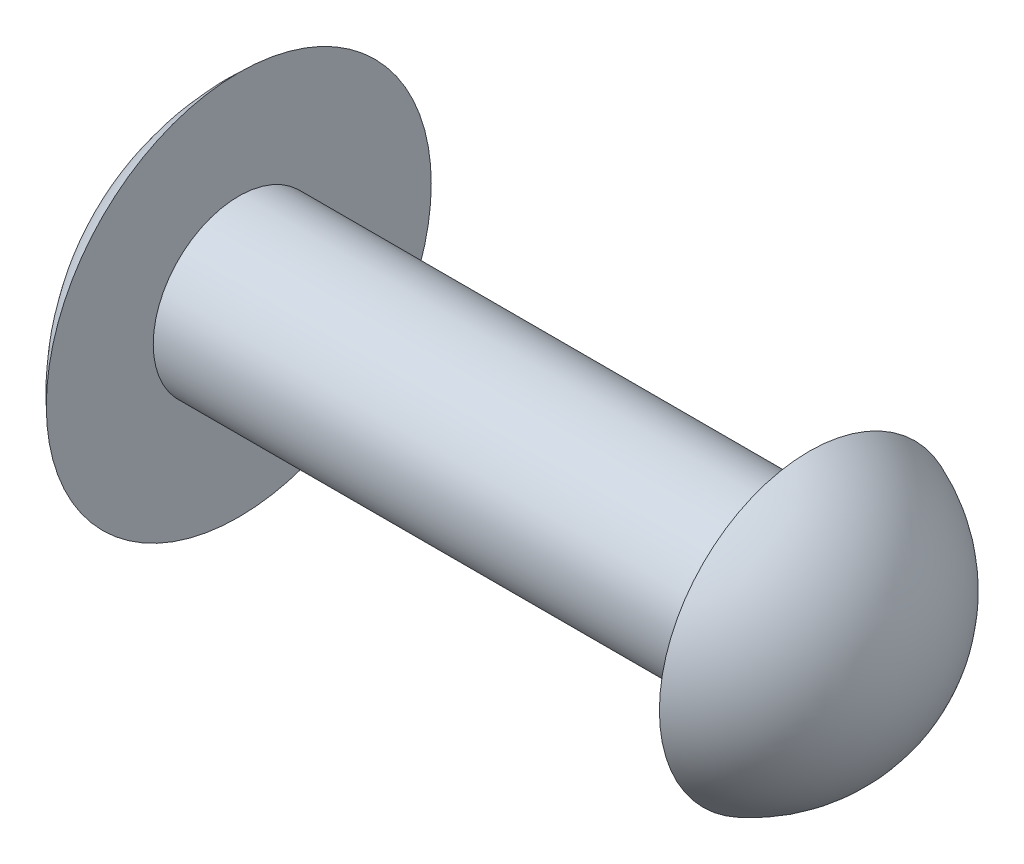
ISO-10303-21;
HEADER;
FILE_DESCRIPTION(('STEP AP214'),'2;1');
FILE_NAME('part.step','',(''),(''),'','','');
FILE_SCHEMA(('AUTOMOTIVE_DESIGN { 1 0 10303 214 1 1 1 1 }'));
ENDSEC;
DATA;
#1=APPLICATION_CONTEXT('core data for automotive mechanical design processes');
#2=APPLICATION_PROTOCOL_DEFINITION('international standard','automotive_design',2000,#1);
#3=PRODUCT_CONTEXT('',#1,'mechanical');
#4=PRODUCT('Part','Part','',(#3));
#5=PRODUCT_RELATED_PRODUCT_CATEGORY('part','',(#4));
#6=PRODUCT_DEFINITION_FORMATION('','',#4);
#7=PRODUCT_DEFINITION_CONTEXT('part definition',#1,'design');
#8=PRODUCT_DEFINITION('design','',#6,#7);
#9=PRODUCT_DEFINITION_SHAPE('','',#8);
#10=(LENGTH_UNIT() NAMED_UNIT(*) SI_UNIT(.MILLI.,.METRE.));
#11=(NAMED_UNIT(*) PLANE_ANGLE_UNIT() SI_UNIT($,.RADIAN.));
#12=(NAMED_UNIT(*) SI_UNIT($,.STERADIAN.) SOLID_ANGLE_UNIT());
#13=UNCERTAINTY_MEASURE_WITH_UNIT(LENGTH_MEASURE(1.E-05),#10,'distance_accuracy_value','');
#14=(GEOMETRIC_REPRESENTATION_CONTEXT(3) GLOBAL_UNCERTAINTY_ASSIGNED_CONTEXT((#13)) GLOBAL_UNIT_ASSIGNED_CONTEXT((#10,
#11,#12)) REPRESENTATION_CONTEXT('',''));
#15=CARTESIAN_POINT('',(0.,0.,0.));
#16=DIRECTION('',(0.,0.,1.));
#17=DIRECTION('',(1.,0.,0.));
#18=AXIS2_PLACEMENT_3D('',#15,#16,#17);
#19=CARTESIAN_POINT('',(-39.,0.,0.));
#20=DIRECTION('',(-1.,0.,0.));
#21=DIRECTION('',(0.,0.,1.));
#22=AXIS2_PLACEMENT_3D('',#19,#20,#21);
#23=CYLINDRICAL_SURFACE('',#22,3.);
#24=CARTESIAN_POINT('',(-20.,0.,0.));
#25=DIRECTION('',(-1.,0.,0.));
#26=DIRECTION('',(0.,0.,1.));
#27=AXIS2_PLACEMENT_3D('',#24,#25,#26);
#28=CIRCLE('',#27,3.);
#29=CARTESIAN_POINT('',(-20.,0.,3.));
#30=VERTEX_POINT('',#29);
#31=EDGE_CURVE('E10',#30,#30,#28,.T.);
#32=ORIENTED_EDGE('',*,*,#31,.F.);
#33=EDGE_LOOP('',(#32));
#34=FACE_BOUND('',#33,.T.);
#35=CARTESIAN_POINT('',(0.,0.,0.));
#36=DIRECTION('',(1.,0.,0.));
#37=DIRECTION('',(0.,0.,-1.));
#38=AXIS2_PLACEMENT_3D('',#35,#36,#37);
#39=CIRCLE('',#38,3.);
#40=CARTESIAN_POINT('',(0.,0.,-3.));
#41=VERTEX_POINT('',#40);
#42=EDGE_CURVE('E41',#41,#41,#39,.T.);
#43=ORIENTED_EDGE('',*,*,#42,.F.);
#44=EDGE_LOOP('',(#43));
#45=FACE_BOUND('',#44,.T.);
#46=ADVANCED_FACE('F31',(#34,#45),#23,.T.);
#47=CARTESIAN_POINT('',(-20.,3.,0.));
#48=DIRECTION('',(-1.,0.,0.));
#49=DIRECTION('',(0.,0.,1.));
#50=AXIS2_PLACEMENT_3D('',#47,#48,#49);
#51=PLANE('',#50);
#52=CARTESIAN_POINT('',(-20.,0.,0.));
#53=DIRECTION('',(-1.,0.,0.));
#54=DIRECTION('',(0.,0.,1.));
#55=AXIS2_PLACEMENT_3D('',#52,#53,#54);
#56=CIRCLE('',#55,6.75);
#57=CARTESIAN_POINT('',(-20.,0.,6.75));
#58=VERTEX_POINT('',#57);
#59=EDGE_CURVE('E37',#58,#58,#56,.T.);
#60=ORIENTED_EDGE('',*,*,#59,.F.);
#61=EDGE_LOOP('',(#60));
#62=FACE_BOUND('',#61,.T.);
#63=ORIENTED_EDGE('',*,*,#31,.T.);
#64=EDGE_LOOP('',(#63));
#65=FACE_BOUND('',#64,.T.);
#66=ADVANCED_FACE('F63',(#62,#65),#51,.F.);
#67=CARTESIAN_POINT('',(-13.90625,0.,0.));
#68=DIRECTION('',(-1.,0.,0.));
#69=DIRECTION('',(0.,1.,0.));
#70=AXIS2_PLACEMENT_3D('',#67,#68,#69);
#71=SPHERICAL_SURFACE('',#70,9.09374999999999);
#72=ORIENTED_EDGE('',*,*,#59,.T.);
#73=EDGE_LOOP('',(#72));
#74=FACE_BOUND('',#73,.T.);
#75=ADVANCED_FACE('F59',(#74),#71,.T.);
#76=CARTESIAN_POINT('',(0.,0.,0.));
#77=DIRECTION('',(1.,0.,0.));
#78=DIRECTION('',(0.,0.,-1.));
#79=AXIS2_PLACEMENT_3D('',#76,#77,#78);
#80=PLANE('',#79);
#81=ORIENTED_EDGE('',*,*,#42,.T.);
#82=EDGE_LOOP('',(#81));
#83=FACE_BOUND('',#82,.T.);
#84=CARTESIAN_POINT('',(0.,0.,0.));
#85=DIRECTION('',(-1.,0.,0.));
#86=DIRECTION('',(0.,0.,1.));
#87=AXIS2_PLACEMENT_3D('',#84,#85,#86);
#88=CIRCLE('',#87,5.25);
#89=CARTESIAN_POINT('',(0.,0.,5.25));
#90=VERTEX_POINT('',#89);
#91=EDGE_CURVE('E45',#90,#90,#88,.T.);
#92=ORIENTED_EDGE('',*,*,#91,.T.);
#93=EDGE_LOOP('',(#92));
#94=FACE_BOUND('',#93,.T.);
#95=ADVANCED_FACE('F51',(#83,#94),#80,.F.);
#96=CARTESIAN_POINT('',(-2.028125,0.,0.));
#97=DIRECTION('',(-1.,0.,0.));
#98=DIRECTION('',(0.,1.,0.));
#99=AXIS2_PLACEMENT_3D('',#96,#97,#98);
#100=SPHERICAL_SURFACE('',#99,5.628125);
#101=ORIENTED_EDGE('',*,*,#91,.F.);
#102=EDGE_LOOP('',(#101));
#103=FACE_BOUND('',#102,.T.);
#104=ADVANCED_FACE('F53',(#103),#100,.T.);
#105=CLOSED_SHELL('',(#46,#66,#75,#95,#104));
#106=MANIFOLD_SOLID_BREP('B2',#105);
#107=ADVANCED_BREP_SHAPE_REPRESENTATION('',(#18,#106),#14);
#108=SHAPE_DEFINITION_REPRESENTATION(#9,#107);
ENDSEC;
END-ISO-10303-21;
